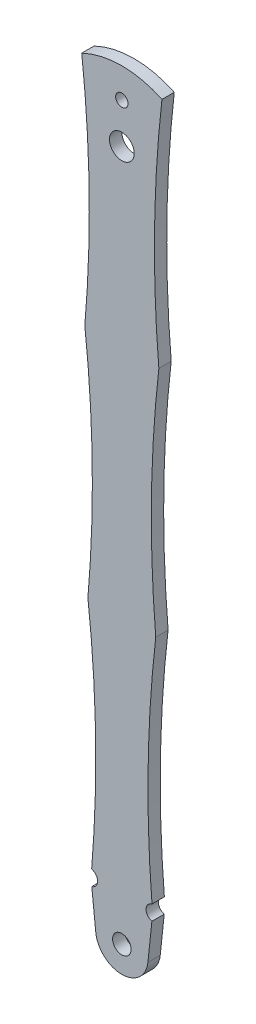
from build123d import *

# Parameters (mm, degrees)
SKETCH1_R           = 1.5
BOSS_EXTRUDE1_DEPTH = 2
SKETCH2_R           = 1.25
CUT_EXTRUDE1_DEPTH  = 128.629625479
CUT_EXTRUDE2_REACH  = 129.63
SKETCH3_R           = 2
SKETCH4_R           = 1
CUT_EXTRUDE3_DEPTH  = 128.629625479


with BuildPart() as part:
    # Sketch1 → Boss-Extrude1 (new body)
    with BuildSketch(Plane.XY):
        with BuildLine():
            ThreePointArc((-15.116382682, 2.639845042), (-10.890036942, -1.162380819), (-6.663691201, 2.639845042))
            Line((-6.663691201, 2.639845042), (-5.890036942, 9.94203179))
            ThreePointArc((-5.890036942, 9.94203179), (-6.643426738, 29.454895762), (-5.390036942, 48.94203179))
            ThreePointArc((-5.390036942, 48.94203179), (-6.092506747, 67.954564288), (-4.890036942, 86.94203179))
            ThreePointArc((-4.890036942, 86.94203179), (-5.592506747, 105.954564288), (-4.390036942, 124.94203179))
            ThreePointArc((-4.390036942, 124.94203179), (-10.890036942, 126.423525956), (-17.390036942, 124.94203179))
            ThreePointArc((-17.390036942, 124.94203179), (-16.187567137, 105.954564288), (-16.890036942, 86.94203179))
            ThreePointArc((-16.890036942, 86.94203179), (-15.687567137, 67.954564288), (-16.390036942, 48.94203179))
            ThreePointArc((-16.390036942, 48.94203179), (-15.136647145, 29.454895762), (-15.890036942, 9.94203179))
            Line((-15.890036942, 9.94203179), (-15.116382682, 2.639845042))
        make_face()
        with Locations((-10.890036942, 3.087619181)):
            Circle(SKETCH1_R, mode=Mode.SUBTRACT)
    extrude(amount=BOSS_EXTRUDE1_DEPTH)

    # Sketch2 → Cut-Extrude1 (cut, through all)
    with BuildSketch(Plane.XY.offset(2)):
        with Locations((-5.714427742, 9.955884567)):
            Circle(SKETCH2_R)
        with Locations((-16.065646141, 9.955884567)):
            Circle(SKETCH2_R)
    extrude(amount=-CUT_EXTRUDE1_DEPTH, mode=Mode.SUBTRACT)

    # Sketch3 → Cut-Extrude2 (cut, up to next)
    with BuildSketch(Plane.XY.offset(2), mode=Mode.PRIVATE) as cut_extrude2_sk1:
        with Locations((-10.890036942, 115.087619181)):
            Circle(SKETCH3_R)
    cut_extrude2_tool1 = extrude(cut_extrude2_sk1.sketch, amount=-CUT_EXTRUDE2_REACH, mode=Mode.PRIVATE) & part.part
    add(cut_extrude2_tool1.solids().sort_by_distance((-10.890037, 115.087619, 2))[0], mode=Mode.SUBTRACT)

    # Sketch4 → Cut-Extrude3 (cut, through all)
    with BuildSketch(Plane.XY.offset(2)):
        with Locations((-10.890036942, 121.587619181)):
            Circle(SKETCH4_R)
    extrude(amount=-CUT_EXTRUDE3_DEPTH, mode=Mode.SUBTRACT)


solid = part.part
